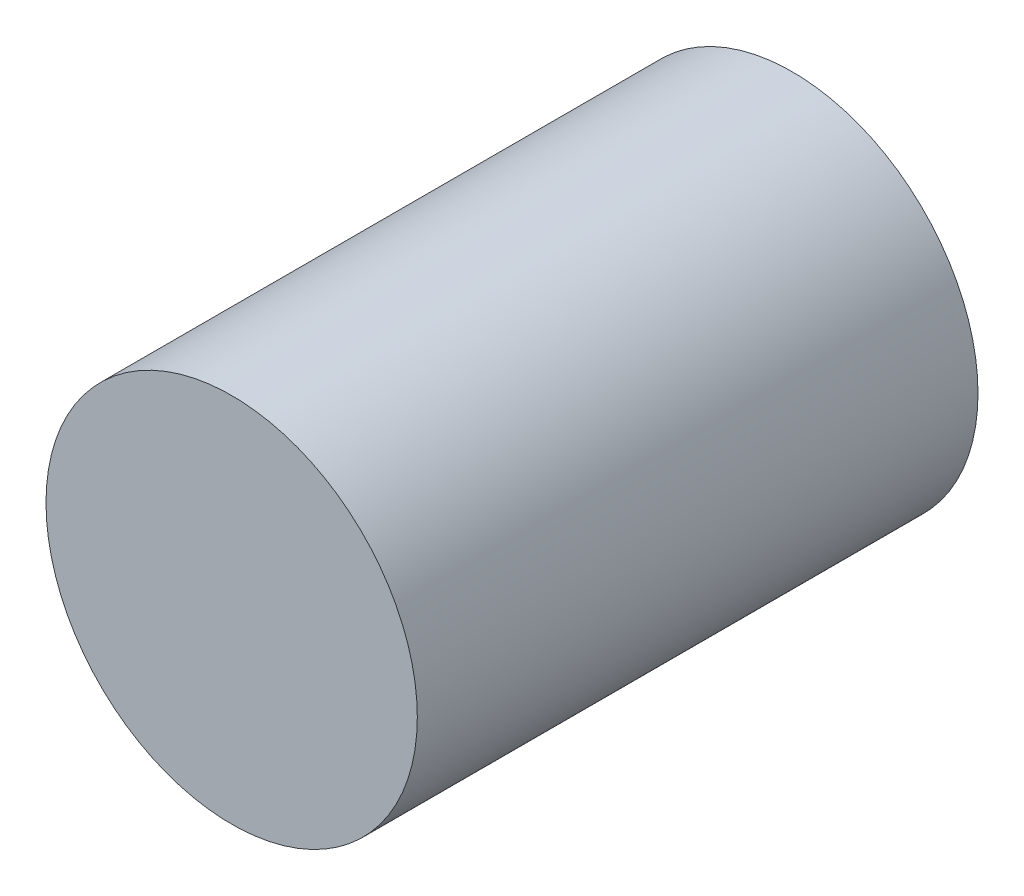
ISO-10303-21;
HEADER;
FILE_DESCRIPTION(('STEP AP214'),'2;1');
FILE_NAME('part.step','',(''),(''),'','','');
FILE_SCHEMA(('AUTOMOTIVE_DESIGN { 1 0 10303 214 1 1 1 1 }'));
ENDSEC;
DATA;
#1=APPLICATION_CONTEXT('core data for automotive mechanical design processes');
#2=APPLICATION_PROTOCOL_DEFINITION('international standard','automotive_design',2000,#1);
#3=PRODUCT_CONTEXT('',#1,'mechanical');
#4=PRODUCT('Part','Part','',(#3));
#5=PRODUCT_RELATED_PRODUCT_CATEGORY('part','',(#4));
#6=PRODUCT_DEFINITION_FORMATION('','',#4);
#7=PRODUCT_DEFINITION_CONTEXT('part definition',#1,'design');
#8=PRODUCT_DEFINITION('design','',#6,#7);
#9=PRODUCT_DEFINITION_SHAPE('','',#8);
#10=(LENGTH_UNIT() NAMED_UNIT(*) SI_UNIT(.MILLI.,.METRE.));
#11=(NAMED_UNIT(*) PLANE_ANGLE_UNIT() SI_UNIT($,.RADIAN.));
#12=(NAMED_UNIT(*) SI_UNIT($,.STERADIAN.) SOLID_ANGLE_UNIT());
#13=UNCERTAINTY_MEASURE_WITH_UNIT(LENGTH_MEASURE(1.E-05),#10,'distance_accuracy_value','');
#14=(GEOMETRIC_REPRESENTATION_CONTEXT(3) GLOBAL_UNCERTAINTY_ASSIGNED_CONTEXT((#13)) GLOBAL_UNIT_ASSIGNED_CONTEXT((#10,
#11,#12)) REPRESENTATION_CONTEXT('',''));
#15=CARTESIAN_POINT('',(0.,0.,0.));
#16=DIRECTION('',(0.,0.,1.));
#17=DIRECTION('',(1.,0.,0.));
#18=AXIS2_PLACEMENT_3D('',#15,#16,#17);
#19=CARTESIAN_POINT('',(0.499999,0.,0.));
#20=DIRECTION('',(0.,0.,-1.));
#21=DIRECTION('',(-1.,0.,0.));
#22=AXIS2_PLACEMENT_3D('',#19,#20,#21);
#23=PLANE('',#22);
#24=CARTESIAN_POINT('',(0.,0.,0.));
#25=DIRECTION('',(0.,0.,-1.));
#26=DIRECTION('',(-1.,0.,0.));
#27=AXIS2_PLACEMENT_3D('',#24,#25,#26);
#28=CIRCLE('',#27,0.499999);
#29=CARTESIAN_POINT('',(-0.499999,0.,0.));
#30=VERTEX_POINT('',#29);
#31=EDGE_CURVE('E17',#30,#30,#28,.F.);
#32=ORIENTED_EDGE('',*,*,#31,.F.);
#33=EDGE_LOOP('',(#32));
#34=FACE_BOUND('',#33,.T.);
#35=ADVANCED_FACE('F14',(#34),#23,.T.);
#36=CARTESIAN_POINT('',(0.499999,0.,1.50999952));
#37=DIRECTION('',(0.,0.,-1.));
#38=DIRECTION('',(-1.,0.,0.));
#39=AXIS2_PLACEMENT_3D('',#36,#37,#38);
#40=PLANE('',#39);
#41=CARTESIAN_POINT('',(0.,0.,1.50999952));
#42=DIRECTION('',(0.,0.,-1.));
#43=DIRECTION('',(-1.,0.,0.));
#44=AXIS2_PLACEMENT_3D('',#41,#42,#43);
#45=CIRCLE('',#44,0.499999);
#46=CARTESIAN_POINT('',(-0.499999,0.,1.50999952));
#47=VERTEX_POINT('',#46);
#48=EDGE_CURVE('E10',#47,#47,#45,.T.);
#49=ORIENTED_EDGE('',*,*,#48,.F.);
#50=EDGE_LOOP('',(#49));
#51=FACE_BOUND('',#50,.T.);
#52=ADVANCED_FACE('F29',(#51),#40,.F.);
#53=CARTESIAN_POINT('',(0.,0.,0.));
#54=DIRECTION('',(0.,0.,-1.));
#55=DIRECTION('',(-1.,0.,0.));
#56=AXIS2_PLACEMENT_3D('',#53,#54,#55);
#57=CYLINDRICAL_SURFACE('',#56,0.499999);
#58=ORIENTED_EDGE('',*,*,#48,.T.);
#59=EDGE_LOOP('',(#58));
#60=FACE_BOUND('',#59,.T.);
#61=ORIENTED_EDGE('',*,*,#31,.T.);
#62=EDGE_LOOP('',(#61));
#63=FACE_BOUND('',#62,.T.);
#64=ADVANCED_FACE('F26',(#60,#63),#57,.T.);
#65=CLOSED_SHELL('',(#35,#52,#64));
#66=MANIFOLD_SOLID_BREP('B1',#65);
#67=ADVANCED_BREP_SHAPE_REPRESENTATION('',(#18,#66),#14);
#68=SHAPE_DEFINITION_REPRESENTATION(#9,#67);
ENDSEC;
END-ISO-10303-21;
